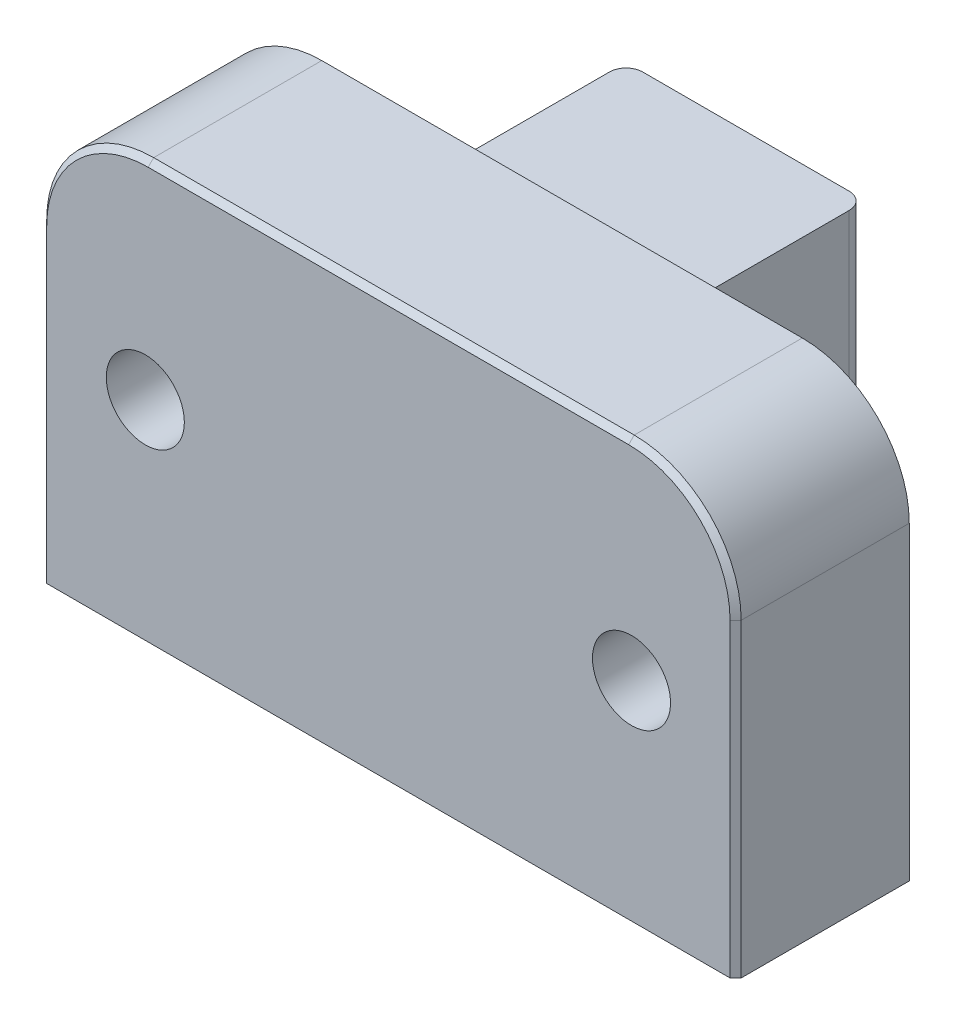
from build123d import *

# Parameters (mm, degrees)
EXTRUDE1_DEPTH     = 38.1
SKETCH3_W          = 50.8
SKETCH3_H          = 8.37699273
SKETCH3_H_2        = 7.62
CUT_EXTRUDE2_DEPTH = 25.4
FILLET2_R          = 1.524
FILLET3_R          = 0.7874
FILLET4_R          = 9.779
CHAMFER1_SIZE      = 0.508


with BuildPart() as part:
    # Sketch1 → Extrude1 (new body)
    with BuildSketch(Plane(origin=(0, 0, 0), x_dir=(1, 0, 0), z_dir=(0, 1, 0))):
        Polygon((-31.74365, 0), (-10.9601, 0), (-10.9601, 16.8148), (10.9601, 16.8148), (10.9601, 0), (31.74365, 0), (31.74365, -15.875), (-31.74365, -15.875), align=None)
    extrude(amount=EXTRUDE1_DEPTH)

    # Sketch3 → Cut-Extrude2 (cut, symmetric)
    with BuildSketch(Plane(origin=(0, 0, 0), x_dir=(0, 0, -1), z_dir=(1, 0, 0))):
        with Locations((25.4, -1.140496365)):
            Rectangle(SKETCH3_W, SKETCH3_H)
        with Locations((25.4, 38.862)):
            Rectangle(SKETCH3_W, SKETCH3_H_2)
    extrude(amount=CUT_EXTRUDE2_DEPTH, both=True, mode=Mode.SUBTRACT)

    # Fillet2
    fillet2_edges = [part.edges().sort_by_distance(p)[0] for p in [
        (-10.9601, 19.05, -16.8148),
        (10.9601, 19.05, -16.8148),
    ]]
    fillet(fillet2_edges, radius=FILLET2_R)

    # Fillet3
    fillet3_edges = [part.edges().sort_by_distance(p)[0] for p in [
        (10.9601, 19.05, 0),
        (-10.9601, 19.05, 0),
    ]]
    fillet(fillet3_edges, radius=FILLET3_R)

    # Fillet4
    fillet4_edges = [part.edges().sort_by_distance(p)[0] for p in [
        (31.74365, 38.1, 7.9375),
        (-31.74365, 38.1, 7.9375),
    ]]
    fillet(fillet4_edges, radius=FILLET4_R)

    # Sketch4 → Cut-Revolve1 (revolve, cut)
    with BuildSketch(Plane(origin=(0, 19.05, 0), x_dir=(-1, 0, 0), z_dir=(0, 1, 0))):
        Polygon((22.225, 15.875), (18.6563, 15.875), (18.6563, 6.7564), (17.0688, 6.7564), (17.0688, 0), (22.225, 0), align=None)
    cut_revolve1 = revolve(axis=Axis((-22.225, 19.05, 26.865158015), (0, 0, -1)), mode=Mode.SUBTRACT)

    # Mirror1: Cut-Revolve1 across plane
    add(cut_revolve1.mirror(Plane(origin=(0, 0, 0), x_dir=(0, 0, 1), z_dir=(1, 0, 0))), mode=Mode.SUBTRACT)

    # Chamfer1
    chamfer1_edges = [part.edges().sort_by_distance(p)[0] for p in [
        (31.74365, 14.1605, 15.875),
        (-31.74365, 14.1605, 15.875),
        (-28.879447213, 35.235797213, 15.875),
        (28.879447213, 35.235797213, 15.875),
        (0, 38.1, 15.875),
    ]]
    chamfer(chamfer1_edges, length=CHAMFER1_SIZE)


solid = part.part
